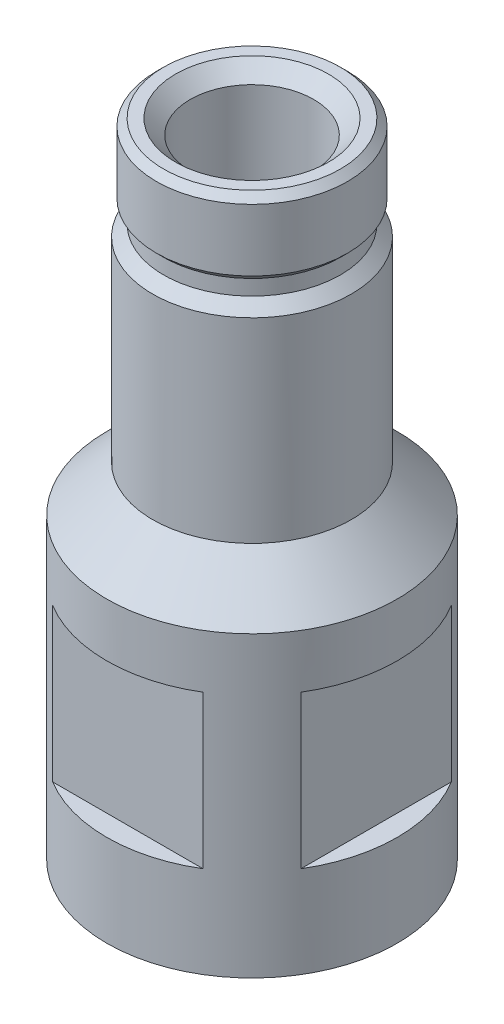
ISO-10303-21;
HEADER;
FILE_DESCRIPTION(('STEP AP214'),'2;1');
FILE_NAME('part.step','',(''),(''),'','','');
FILE_SCHEMA(('AUTOMOTIVE_DESIGN { 1 0 10303 214 1 1 1 1 }'));
ENDSEC;
DATA;
#1=APPLICATION_CONTEXT('core data for automotive mechanical design processes');
#2=APPLICATION_PROTOCOL_DEFINITION('international standard','automotive_design',2000,#1);
#3=PRODUCT_CONTEXT('',#1,'mechanical');
#4=PRODUCT('Part','Part','',(#3));
#5=PRODUCT_RELATED_PRODUCT_CATEGORY('part','',(#4));
#6=PRODUCT_DEFINITION_FORMATION('','',#4);
#7=PRODUCT_DEFINITION_CONTEXT('part definition',#1,'design');
#8=PRODUCT_DEFINITION('design','',#6,#7);
#9=PRODUCT_DEFINITION_SHAPE('','',#8);
#10=(LENGTH_UNIT() NAMED_UNIT(*) SI_UNIT(.MILLI.,.METRE.));
#11=(NAMED_UNIT(*) PLANE_ANGLE_UNIT() SI_UNIT($,.RADIAN.));
#12=(NAMED_UNIT(*) SI_UNIT($,.STERADIAN.) SOLID_ANGLE_UNIT());
#13=UNCERTAINTY_MEASURE_WITH_UNIT(LENGTH_MEASURE(1.E-05),#10,'distance_accuracy_value','');
#14=(GEOMETRIC_REPRESENTATION_CONTEXT(3) GLOBAL_UNCERTAINTY_ASSIGNED_CONTEXT((#13)) GLOBAL_UNIT_ASSIGNED_CONTEXT((#10,
#11,#12)) REPRESENTATION_CONTEXT('',''));
#15=CARTESIAN_POINT('',(0.,0.,0.));
#16=DIRECTION('',(0.,0.,1.));
#17=DIRECTION('',(1.,0.,0.));
#18=AXIS2_PLACEMENT_3D('',#15,#16,#17);
#19=CARTESIAN_POINT('',(0.,0.,0.));
#20=DIRECTION('',(0.,1.,0.));
#21=DIRECTION('',(0.,0.,1.));
#22=AXIS2_PLACEMENT_3D('',#19,#20,#21);
#23=PLANE('',#22);
#24=CARTESIAN_POINT('',(0.,0.,0.));
#25=DIRECTION('',(0.,1.,0.));
#26=DIRECTION('',(0.,0.,1.));
#27=AXIS2_PLACEMENT_3D('',#24,#25,#26);
#28=CIRCLE('',#27,11.1506);
#29=CARTESIAN_POINT('',(0.,0.,11.1506));
#30=VERTEX_POINT('',#29);
#31=EDGE_CURVE('E359',#30,#30,#28,.T.);
#32=ORIENTED_EDGE('',*,*,#31,.T.);
#33=EDGE_LOOP('',(#32));
#34=FACE_BOUND('',#33,.T.);
#35=CARTESIAN_POINT('',(0.,0.,0.));
#36=DIRECTION('',(0.,1.,0.));
#37=DIRECTION('',(0.,0.,1.));
#38=AXIS2_PLACEMENT_3D('',#35,#36,#37);
#39=CIRCLE('',#38,12.065);
#40=CARTESIAN_POINT('',(0.,0.,12.065));
#41=VERTEX_POINT('',#40);
#42=EDGE_CURVE('E125',#41,#41,#39,.T.);
#43=ORIENTED_EDGE('',*,*,#42,.F.);
#44=EDGE_LOOP('',(#43));
#45=FACE_BOUND('',#44,.T.);
#46=ADVANCED_FACE('F35',(#34,#45),#23,.F.);
#47=CARTESIAN_POINT('',(0.,53.34,0.));
#48=DIRECTION('',(0.,-1.,0.));
#49=DIRECTION('',(0.,0.,-1.));
#50=AXIS2_PLACEMENT_3D('',#47,#48,#49);
#51=CYLINDRICAL_SURFACE('',#50,12.065);
#52=DIRECTION('',(0.,-1.,0.));
#53=VECTOR('',#52,1.);
#54=CARTESIAN_POINT('',(6.25200955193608,53.34,-10.31875));
#55=LINE('',#54,#53);
#56=CARTESIAN_POINT('',(6.25200955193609,20.32,-10.31875));
#57=VERTEX_POINT('',#56);
#58=CARTESIAN_POINT('',(6.25200955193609,7.62,-10.31875));
#59=VERTEX_POINT('',#58);
#60=EDGE_CURVE('E143',#57,#59,#55,.T.);
#61=ORIENTED_EDGE('',*,*,#60,.F.);
#62=CARTESIAN_POINT('',(0.,20.32,0.));
#63=DIRECTION('',(0.,-1.,0.));
#64=DIRECTION('',(0.,0.,-1.));
#65=AXIS2_PLACEMENT_3D('',#62,#63,#64);
#66=CIRCLE('',#65,12.065);
#67=CARTESIAN_POINT('',(-6.25200955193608,20.32,-10.31875));
#68=VERTEX_POINT('',#67);
#69=EDGE_CURVE('E136',#68,#57,#66,.T.);
#70=ORIENTED_EDGE('',*,*,#69,.F.);
#71=DIRECTION('',(0.,-1.,0.));
#72=VECTOR('',#71,1.);
#73=CARTESIAN_POINT('',(-6.25200955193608,53.34,-10.31875));
#74=LINE('',#73,#72);
#75=CARTESIAN_POINT('',(-6.25200955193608,7.62,-10.31875));
#76=VERTEX_POINT('',#75);
#77=EDGE_CURVE('E139',#76,#68,#74,.F.);
#78=ORIENTED_EDGE('',*,*,#77,.F.);
#79=CARTESIAN_POINT('',(0.,7.62,0.));
#80=DIRECTION('',(0.,-1.,0.));
#81=DIRECTION('',(0.,0.,-1.));
#82=AXIS2_PLACEMENT_3D('',#79,#80,#81);
#83=CIRCLE('',#82,12.065);
#84=EDGE_CURVE('E129',#76,#59,#83,.T.);
#85=ORIENTED_EDGE('',*,*,#84,.T.);
#86=EDGE_LOOP('',(#61,#70,#78,#85));
#87=FACE_BOUND('',#86,.T.);
#88=DIRECTION('',(0.,-1.,0.));
#89=VECTOR('',#88,1.);
#90=CARTESIAN_POINT('',(-6.25200955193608,53.34,10.31875));
#91=LINE('',#90,#89);
#92=CARTESIAN_POINT('',(-6.25200955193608,20.32,10.31875));
#93=VERTEX_POINT('',#92);
#94=CARTESIAN_POINT('',(-6.25200955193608,7.62,10.31875));
#95=VERTEX_POINT('',#94);
#96=EDGE_CURVE('E99',#93,#95,#91,.T.);
#97=ORIENTED_EDGE('',*,*,#96,.F.);
#98=CARTESIAN_POINT('',(6.25200955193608,20.32,10.31875));
#99=VERTEX_POINT('',#98);
#100=EDGE_CURVE('E110',#99,#93,#66,.T.);
#101=ORIENTED_EDGE('',*,*,#100,.F.);
#102=DIRECTION('',(0.,-1.,0.));
#103=VECTOR('',#102,1.);
#104=CARTESIAN_POINT('',(6.25200955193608,53.34,10.31875));
#105=LINE('',#104,#103);
#106=CARTESIAN_POINT('',(6.25200955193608,7.62,10.31875));
#107=VERTEX_POINT('',#106);
#108=EDGE_CURVE('E119',#107,#99,#105,.F.);
#109=ORIENTED_EDGE('',*,*,#108,.F.);
#110=EDGE_CURVE('E114',#107,#95,#83,.T.);
#111=ORIENTED_EDGE('',*,*,#110,.T.);
#112=EDGE_LOOP('',(#97,#101,#109,#111));
#113=FACE_BOUND('',#112,.T.);
#114=CARTESIAN_POINT('',(0.,24.7649999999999,0.));
#115=DIRECTION('',(0.,1.,0.));
#116=DIRECTION('',(-1.,0.,0.));
#117=AXIS2_PLACEMENT_3D('',#114,#115,#116);
#118=CIRCLE('',#117,12.065);
#119=CARTESIAN_POINT('',(-12.065,24.765,0.));
#120=VERTEX_POINT('',#119);
#121=EDGE_CURVE('E195',#120,#120,#118,.T.);
#122=ORIENTED_EDGE('',*,*,#121,.F.);
#123=EDGE_LOOP('',(#122));
#124=FACE_BOUND('',#123,.T.);
#125=ORIENTED_EDGE('',*,*,#42,.T.);
#126=EDGE_LOOP('',(#125));
#127=FACE_BOUND('',#126,.T.);
#128=DIRECTION('',(0.,-1.,0.));
#129=VECTOR('',#128,1.);
#130=CARTESIAN_POINT('',(-10.31875,53.34,-6.25200955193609));
#131=LINE('',#130,#129);
#132=CARTESIAN_POINT('',(-10.31875,20.32,-6.25200955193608));
#133=VERTEX_POINT('',#132);
#134=CARTESIAN_POINT('',(-10.31875,7.62,-6.25200955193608));
#135=VERTEX_POINT('',#134);
#136=EDGE_CURVE('E135',#133,#135,#131,.T.);
#137=ORIENTED_EDGE('',*,*,#136,.F.);
#138=CARTESIAN_POINT('',(-10.31875,20.32,6.25200955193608));
#139=VERTEX_POINT('',#138);
#140=EDGE_CURVE('E124',#139,#133,#66,.T.);
#141=ORIENTED_EDGE('',*,*,#140,.F.);
#142=DIRECTION('',(0.,-1.,0.));
#143=VECTOR('',#142,1.);
#144=CARTESIAN_POINT('',(-10.31875,53.34,6.25200955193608));
#145=LINE('',#144,#143);
#146=CARTESIAN_POINT('',(-10.31875,7.62,6.25200955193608));
#147=VERTEX_POINT('',#146);
#148=EDGE_CURVE('E109',#147,#139,#145,.F.);
#149=ORIENTED_EDGE('',*,*,#148,.F.);
#150=EDGE_CURVE('E122',#147,#135,#83,.T.);
#151=ORIENTED_EDGE('',*,*,#150,.T.);
#152=EDGE_LOOP('',(#137,#141,#149,#151));
#153=FACE_BOUND('',#152,.T.);
#154=DIRECTION('',(0.,-1.,0.));
#155=VECTOR('',#154,1.);
#156=CARTESIAN_POINT('',(10.31875,53.34,6.25200955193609));
#157=LINE('',#156,#155);
#158=CARTESIAN_POINT('',(10.31875,20.32,6.25200955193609));
#159=VERTEX_POINT('',#158);
#160=CARTESIAN_POINT('',(10.31875,7.62,6.25200955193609));
#161=VERTEX_POINT('',#160);
#162=EDGE_CURVE('E12',#159,#161,#157,.T.);
#163=ORIENTED_EDGE('',*,*,#162,.F.);
#164=CARTESIAN_POINT('',(10.31875,20.32,-6.25200955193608));
#165=VERTEX_POINT('',#164);
#166=EDGE_CURVE('E43',#165,#159,#66,.T.);
#167=ORIENTED_EDGE('',*,*,#166,.F.);
#168=DIRECTION('',(0.,-1.,0.));
#169=VECTOR('',#168,1.);
#170=CARTESIAN_POINT('',(10.31875,53.34,-6.25200955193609));
#171=LINE('',#170,#169);
#172=CARTESIAN_POINT('',(10.31875,7.62,-6.25200955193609));
#173=VERTEX_POINT('',#172);
#174=EDGE_CURVE('E128',#173,#165,#171,.F.);
#175=ORIENTED_EDGE('',*,*,#174,.F.);
#176=EDGE_CURVE('E121',#173,#161,#83,.T.);
#177=ORIENTED_EDGE('',*,*,#176,.T.);
#178=EDGE_LOOP('',(#163,#167,#175,#177));
#179=FACE_BOUND('',#178,.T.);
#180=ADVANCED_FACE('F37',(#87,#113,#124,#127,#153,#179),#51,.T.);
#181=CARTESIAN_POINT('',(0.,53.34,0.));
#182=DIRECTION('',(0.,1.,0.));
#183=DIRECTION('',(0.,0.,1.));
#184=AXIS2_PLACEMENT_3D('',#181,#182,#183);
#185=PLANE('',#184);
#186=CARTESIAN_POINT('',(0.,53.34,0.));
#187=DIRECTION('',(0.,1.,0.));
#188=DIRECTION('',(-1.,0.,0.));
#189=AXIS2_PLACEMENT_3D('',#186,#187,#188);
#190=CIRCLE('',#189,6.35000000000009);
#191=CARTESIAN_POINT('',(-6.35000000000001,53.34,0.));
#192=VERTEX_POINT('',#191);
#193=EDGE_CURVE('E216',#192,#192,#190,.T.);
#194=ORIENTED_EDGE('',*,*,#193,.F.);
#195=EDGE_LOOP('',(#194));
#196=FACE_BOUND('',#195,.T.);
#197=CARTESIAN_POINT('',(0.,53.3400000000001,0.));
#198=DIRECTION('',(0.,-1.,0.));
#199=DIRECTION('',(1.,0.,0.));
#200=AXIS2_PLACEMENT_3D('',#197,#198,#199);
#201=CIRCLE('',#200,7.34060000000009);
#202=CARTESIAN_POINT('',(7.34060000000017,53.3400000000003,0.));
#203=VERTEX_POINT('',#202);
#204=EDGE_CURVE('E174',#203,#203,#201,.T.);
#205=ORIENTED_EDGE('',*,*,#204,.F.);
#206=EDGE_LOOP('',(#205));
#207=FACE_BOUND('',#206,.T.);
#208=ADVANCED_FACE('F229',(#196,#207),#185,.T.);
#209=CARTESIAN_POINT('',(0.,0.,0.));
#210=DIRECTION('',(0.,1.,0.));
#211=DIRECTION('',(-1.,0.,0.));
#212=AXIS2_PLACEMENT_3D('',#209,#210,#211);
#213=CYLINDRICAL_SURFACE('',#212,8.25500000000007);
#214=CARTESIAN_POINT('',(0.,28.575,0.));
#215=DIRECTION('',(0.,1.,0.));
#216=DIRECTION('',(-1.,0.,0.));
#217=AXIS2_PLACEMENT_3D('',#214,#215,#216);
#218=CIRCLE('',#217,8.25500000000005);
#219=CARTESIAN_POINT('',(-8.255,28.575,0.));
#220=VERTEX_POINT('',#219);
#221=EDGE_CURVE('E192',#220,#220,#218,.T.);
#222=ORIENTED_EDGE('',*,*,#221,.T.);
#223=EDGE_LOOP('',(#222));
#224=FACE_BOUND('',#223,.T.);
#225=CARTESIAN_POINT('',(2.6162884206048E-13,44.8056000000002,0.));
#226=DIRECTION('',(0.,-1.,0.));
#227=DIRECTION('',(1.,0.,0.));
#228=AXIS2_PLACEMENT_3D('',#225,#226,#227);
#229=CIRCLE('',#228,8.25500000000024);
#230=CARTESIAN_POINT('',(8.25500000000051,44.8056000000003,0.));
#231=VERTEX_POINT('',#230);
#232=EDGE_CURVE('E189',#231,#231,#229,.T.);
#233=ORIENTED_EDGE('',*,*,#232,.T.);
#234=EDGE_LOOP('',(#233));
#235=FACE_BOUND('',#234,.T.);
#236=ADVANCED_FACE('F234',(#224,#235),#213,.T.);
#237=CARTESIAN_POINT('',(0.,0.,0.));
#238=DIRECTION('',(0.,1.,0.));
#239=DIRECTION('',(0.,0.,1.));
#240=AXIS2_PLACEMENT_3D('',#237,#238,#239);
#241=CIRCLE('',#240,8.5852);
#242=CARTESIAN_POINT('',(0.,0.,8.5852));
#243=VERTEX_POINT('',#242);
#244=EDGE_CURVE('E248',#243,#243,#241,.T.);
#245=ORIENTED_EDGE('',*,*,#244,.F.);
#246=EDGE_LOOP('',(#245));
#247=FACE_BOUND('',#246,.T.);
#248=CARTESIAN_POINT('',(0.,0.,0.));
#249=DIRECTION('',(0.,1.,0.));
#250=DIRECTION('',(-1.,0.,0.));
#251=AXIS2_PLACEMENT_3D('',#248,#249,#250);
#252=CIRCLE('',#251,6.1341);
#253=CARTESIAN_POINT('',(-6.1341,0.,0.));
#254=VERTEX_POINT('',#253);
#255=EDGE_CURVE('E198',#254,#254,#252,.T.);
#256=ORIENTED_EDGE('',*,*,#255,.T.);
#257=EDGE_LOOP('',(#256));
#258=FACE_BOUND('',#257,.T.);
#259=ADVANCED_FACE('F225',(#247,#258),#23,.F.);
#260=CARTESIAN_POINT('',(0.,53.34,0.));
#261=DIRECTION('',(0.,1.,0.));
#262=DIRECTION('',(-1.,0.,0.));
#263=AXIS2_PLACEMENT_3D('',#260,#261,#262);
#264=CONICAL_SURFACE('',#263,6.35000000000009,0.785398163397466);
#265=CARTESIAN_POINT('',(0.,52.1208,0.));
#266=DIRECTION('',(0.,1.,0.));
#267=DIRECTION('',(-1.,0.,0.));
#268=AXIS2_PLACEMENT_3D('',#265,#266,#267);
#269=CIRCLE('',#268,5.13080000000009);
#270=CARTESIAN_POINT('',(-5.1308,52.1208,0.));
#271=VERTEX_POINT('',#270);
#272=EDGE_CURVE('E213',#271,#271,#269,.T.);
#273=ORIENTED_EDGE('',*,*,#272,.F.);
#274=EDGE_LOOP('',(#273));
#275=FACE_BOUND('',#274,.T.);
#276=ORIENTED_EDGE('',*,*,#193,.T.);
#277=EDGE_LOOP('',(#276));
#278=FACE_BOUND('',#277,.T.);
#279=ADVANCED_FACE('F233',(#275,#278),#264,.F.);
#280=CARTESIAN_POINT('',(0.,0.,0.));
#281=DIRECTION('',(0.,1.,0.));
#282=DIRECTION('',(-1.,0.,0.));
#283=AXIS2_PLACEMENT_3D('',#280,#281,#282);
#284=CYLINDRICAL_SURFACE('',#283,5.13080000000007);
#285=CARTESIAN_POINT('',(0.,25.4,0.));
#286=DIRECTION('',(0.,1.,0.));
#287=DIRECTION('',(-1.,0.,0.));
#288=AXIS2_PLACEMENT_3D('',#285,#286,#287);
#289=CIRCLE('',#288,5.13080000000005);
#290=CARTESIAN_POINT('',(-5.13080000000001,25.4,0.));
#291=VERTEX_POINT('',#290);
#292=EDGE_CURVE('E210',#291,#291,#289,.T.);
#293=ORIENTED_EDGE('',*,*,#292,.F.);
#294=EDGE_LOOP('',(#293));
#295=FACE_BOUND('',#294,.T.);
#296=ORIENTED_EDGE('',*,*,#272,.T.);
#297=EDGE_LOOP('',(#296));
#298=FACE_BOUND('',#297,.T.);
#299=ADVANCED_FACE('F240',(#295,#298),#284,.F.);
#300=CARTESIAN_POINT('',(-5.7531,25.4,0.));
#301=DIRECTION('',(0.,1.,0.));
#302=DIRECTION('',(-1.,0.,0.));
#303=AXIS2_PLACEMENT_3D('',#300,#301,#302);
#304=PLANE('',#303);
#305=CARTESIAN_POINT('',(0.,25.4,0.));
#306=DIRECTION('',(0.,1.,0.));
#307=DIRECTION('',(-1.,0.,0.));
#308=AXIS2_PLACEMENT_3D('',#305,#306,#307);
#309=CIRCLE('',#308,5.75310000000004);
#310=CARTESIAN_POINT('',(-5.7531,25.4,0.));
#311=VERTEX_POINT('',#310);
#312=EDGE_CURVE('E207',#311,#311,#309,.T.);
#313=ORIENTED_EDGE('',*,*,#312,.F.);
#314=EDGE_LOOP('',(#313));
#315=FACE_BOUND('',#314,.T.);
#316=ORIENTED_EDGE('',*,*,#292,.T.);
#317=EDGE_LOOP('',(#316));
#318=FACE_BOUND('',#317,.T.);
#319=ADVANCED_FACE('F267',(#315,#318),#304,.F.);
#320=CARTESIAN_POINT('',(0.,0.,0.));
#321=DIRECTION('',(0.,1.,0.));
#322=DIRECTION('',(-1.,0.,0.));
#323=AXIS2_PLACEMENT_3D('',#320,#321,#322);
#324=CYLINDRICAL_SURFACE('',#323,5.75310000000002);
#325=CARTESIAN_POINT('',(0.,3.39497045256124,0.));
#326=DIRECTION('',(0.,1.,0.));
#327=DIRECTION('',(-1.,0.,0.));
#328=AXIS2_PLACEMENT_3D('',#325,#326,#327);
#329=CIRCLE('',#328,5.75310000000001);
#330=CARTESIAN_POINT('',(-5.7531,3.39497045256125,0.));
#331=VERTEX_POINT('',#330);
#332=EDGE_CURVE('E204',#331,#331,#329,.T.);
#333=ORIENTED_EDGE('',*,*,#332,.F.);
#334=EDGE_LOOP('',(#333));
#335=FACE_BOUND('',#334,.T.);
#336=ORIENTED_EDGE('',*,*,#312,.T.);
#337=EDGE_LOOP('',(#336));
#338=FACE_BOUND('',#337,.T.);
#339=ADVANCED_FACE('F261',(#335,#338),#324,.F.);
#340=CARTESIAN_POINT('',(0.,3.39497045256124,0.));
#341=DIRECTION('',(0.,-1.,0.));
#342=DIRECTION('',(1.,0.,0.));
#343=AXIS2_PLACEMENT_3D('',#340,#341,#342);
#344=CONICAL_SURFACE('',#343,5.75310000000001,1.0471975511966);
#345=CARTESIAN_POINT('',(0.,3.17499999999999,0.));
#346=DIRECTION('',(0.,1.,0.));
#347=DIRECTION('',(-1.,0.,0.));
#348=AXIS2_PLACEMENT_3D('',#345,#346,#347);
#349=CIRCLE('',#348,6.1341);
#350=CARTESIAN_POINT('',(-6.1341,3.175,0.));
#351=VERTEX_POINT('',#350);
#352=EDGE_CURVE('E201',#351,#351,#349,.T.);
#353=ORIENTED_EDGE('',*,*,#352,.F.);
#354=EDGE_LOOP('',(#353));
#355=FACE_BOUND('',#354,.T.);
#356=ORIENTED_EDGE('',*,*,#332,.T.);
#357=EDGE_LOOP('',(#356));
#358=FACE_BOUND('',#357,.T.);
#359=ADVANCED_FACE('F255',(#355,#358),#344,.F.);
#360=CARTESIAN_POINT('',(0.,0.,0.));
#361=DIRECTION('',(0.,1.,0.));
#362=DIRECTION('',(-1.,0.,0.));
#363=AXIS2_PLACEMENT_3D('',#360,#361,#362);
#364=CYLINDRICAL_SURFACE('',#363,6.1341);
#365=ORIENTED_EDGE('',*,*,#255,.F.);
#366=EDGE_LOOP('',(#365));
#367=FACE_BOUND('',#366,.T.);
#368=ORIENTED_EDGE('',*,*,#352,.T.);
#369=EDGE_LOOP('',(#368));
#370=FACE_BOUND('',#369,.T.);
#371=ADVANCED_FACE('F251',(#367,#370),#364,.F.);
#372=CARTESIAN_POINT('',(0.,24.7649999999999,0.));
#373=DIRECTION('',(0.,-1.,0.));
#374=DIRECTION('',(1.,0.,0.));
#375=AXIS2_PLACEMENT_3D('',#372,#373,#374);
#376=CONICAL_SURFACE('',#375,12.065,0.785398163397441);
#377=ORIENTED_EDGE('',*,*,#221,.F.);
#378=EDGE_LOOP('',(#377));
#379=FACE_BOUND('',#378,.T.);
#380=ORIENTED_EDGE('',*,*,#121,.T.);
#381=EDGE_LOOP('',(#380));
#382=FACE_BOUND('',#381,.T.);
#383=ADVANCED_FACE('F254',(#379,#382),#376,.T.);
#384=CARTESIAN_POINT('',(2.6162884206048E-13,44.8056000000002,0.));
#385=DIRECTION('',(0.,-1.,0.));
#386=DIRECTION('',(1.,0.,0.));
#387=AXIS2_PLACEMENT_3D('',#384,#385,#386);
#388=CONICAL_SURFACE('',#387,8.25500000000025,0.785398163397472);
#389=CARTESIAN_POINT('',(2.42983273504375E-13,45.7200000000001,0.));
#390=DIRECTION('',(0.,-1.,0.));
#391=DIRECTION('',(1.,0.,0.));
#392=AXIS2_PLACEMENT_3D('',#389,#390,#391);
#393=CIRCLE('',#392,7.34060000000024);
#394=CARTESIAN_POINT('',(7.34060000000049,45.7200000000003,0.));
#395=VERTEX_POINT('',#394);
#396=EDGE_CURVE('E186',#395,#395,#393,.T.);
#397=ORIENTED_EDGE('',*,*,#396,.T.);
#398=EDGE_LOOP('',(#397));
#399=FACE_BOUND('',#398,.T.);
#400=ORIENTED_EDGE('',*,*,#232,.F.);
#401=EDGE_LOOP('',(#400));
#402=FACE_BOUND('',#401,.T.);
#403=ADVANCED_FACE('F308',(#399,#402),#388,.T.);
#404=CARTESIAN_POINT('',(0.,53.34,0.));
#405=DIRECTION('',(0.,-1.,0.));
#406=DIRECTION('',(1.,0.,0.));
#407=AXIS2_PLACEMENT_3D('',#404,#405,#406);
#408=CYLINDRICAL_SURFACE('',#407,7.34060000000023);
#409=CARTESIAN_POINT('',(2.17086650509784E-13,46.9900000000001,0.));
#410=DIRECTION('',(0.,-1.,0.));
#411=DIRECTION('',(1.,0.,0.));
#412=AXIS2_PLACEMENT_3D('',#409,#410,#411);
#413=CIRCLE('',#412,7.34060000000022);
#414=CARTESIAN_POINT('',(7.34060000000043,46.9900000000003,0.));
#415=VERTEX_POINT('',#414);
#416=EDGE_CURVE('E183',#415,#415,#413,.T.);
#417=ORIENTED_EDGE('',*,*,#416,.T.);
#418=EDGE_LOOP('',(#417));
#419=FACE_BOUND('',#418,.T.);
#420=ORIENTED_EDGE('',*,*,#396,.F.);
#421=EDGE_LOOP('',(#420));
#422=FACE_BOUND('',#421,.T.);
#423=ADVANCED_FACE('F302',(#419,#422),#408,.T.);
#424=CARTESIAN_POINT('',(2.17086650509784E-13,46.9900000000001,0.));
#425=DIRECTION('',(0.,1.,0.));
#426=DIRECTION('',(-1.,0.,0.));
#427=AXIS2_PLACEMENT_3D('',#424,#425,#426);
#428=CONICAL_SURFACE('',#427,7.34060000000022,0.785398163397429);
#429=CARTESIAN_POINT('',(2.04915237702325E-13,47.5869000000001,0.));
#430=DIRECTION('',(0.,-1.,0.));
#431=DIRECTION('',(1.,0.,0.));
#432=AXIS2_PLACEMENT_3D('',#429,#430,#431);
#433=CIRCLE('',#432,7.93750000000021);
#434=CARTESIAN_POINT('',(7.93750000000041,47.5869000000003,0.));
#435=VERTEX_POINT('',#434);
#436=EDGE_CURVE('E180',#435,#435,#433,.T.);
#437=ORIENTED_EDGE('',*,*,#436,.T.);
#438=EDGE_LOOP('',(#437));
#439=FACE_BOUND('',#438,.T.);
#440=ORIENTED_EDGE('',*,*,#416,.F.);
#441=EDGE_LOOP('',(#440));
#442=FACE_BOUND('',#441,.T.);
#443=ADVANCED_FACE('F296',(#439,#442),#428,.T.);
#444=CARTESIAN_POINT('',(0.,53.34,0.));
#445=DIRECTION('',(0.,-1.,0.));
#446=DIRECTION('',(1.,0.,0.));
#447=AXIS2_PLACEMENT_3D('',#444,#445,#446);
#448=CYLINDRICAL_SURFACE('',#447,7.93750000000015);
#449=CARTESIAN_POINT('',(0.,52.7431000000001,0.));
#450=DIRECTION('',(0.,-1.,0.));
#451=DIRECTION('',(1.,0.,0.));
#452=AXIS2_PLACEMENT_3D('',#449,#450,#451);
#453=CIRCLE('',#452,7.9375000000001);
#454=CARTESIAN_POINT('',(7.9375000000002,52.7431000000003,0.));
#455=VERTEX_POINT('',#454);
#456=EDGE_CURVE('E177',#455,#455,#453,.T.);
#457=ORIENTED_EDGE('',*,*,#456,.T.);
#458=EDGE_LOOP('',(#457));
#459=FACE_BOUND('',#458,.T.);
#460=ORIENTED_EDGE('',*,*,#436,.F.);
#461=EDGE_LOOP('',(#460));
#462=FACE_BOUND('',#461,.T.);
#463=ADVANCED_FACE('F290',(#459,#462),#448,.T.);
#464=CARTESIAN_POINT('',(0.,52.7431000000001,0.));
#465=DIRECTION('',(0.,-1.,0.));
#466=DIRECTION('',(1.,0.,0.));
#467=AXIS2_PLACEMENT_3D('',#464,#465,#466);
#468=CONICAL_SURFACE('',#467,7.9375000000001,0.785398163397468);
#469=ORIENTED_EDGE('',*,*,#204,.T.);
#470=EDGE_LOOP('',(#469));
#471=FACE_BOUND('',#470,.T.);
#472=ORIENTED_EDGE('',*,*,#456,.F.);
#473=EDGE_LOOP('',(#472));
#474=FACE_BOUND('',#473,.T.);
#475=ADVANCED_FACE('F287',(#471,#474),#468,.T.);
#476=CARTESIAN_POINT('',(-10.31875,20.32,10.31875));
#477=DIRECTION('',(0.,0.,1.));
#478=DIRECTION('',(1.,0.,0.));
#479=AXIS2_PLACEMENT_3D('',#476,#477,#478);
#480=PLANE('',#479);
#481=ORIENTED_EDGE('',*,*,#96,.T.);
#482=DIRECTION('',(-1.,0.,0.));
#483=VECTOR('',#482,1.);
#484=CARTESIAN_POINT('',(-10.31875,7.62,10.31875));
#485=LINE('',#484,#483);
#486=EDGE_CURVE('E102',#107,#95,#485,.T.);
#487=ORIENTED_EDGE('',*,*,#486,.F.);
#488=ORIENTED_EDGE('',*,*,#108,.T.);
#489=DIRECTION('',(-1.,0.,0.));
#490=VECTOR('',#489,1.);
#491=CARTESIAN_POINT('',(-10.31875,20.32,10.31875));
#492=LINE('',#491,#490);
#493=EDGE_CURVE('E105',#99,#93,#492,.T.);
#494=ORIENTED_EDGE('',*,*,#493,.T.);
#495=EDGE_LOOP('',(#481,#487,#488,#494));
#496=FACE_BOUND('',#495,.T.);
#497=ADVANCED_FACE('F101',(#496),#480,.T.);
#498=CARTESIAN_POINT('',(0.,7.62,0.));
#499=DIRECTION('',(0.,-1.,0.));
#500=DIRECTION('',(0.,0.,-1.));
#501=AXIS2_PLACEMENT_3D('',#498,#499,#500);
#502=PLANE('',#501);
#503=ORIENTED_EDGE('',*,*,#486,.T.);
#504=ORIENTED_EDGE('',*,*,#110,.F.);
#505=EDGE_LOOP('',(#503,#504));
#506=FACE_BOUND('',#505,.T.);
#507=ADVANCED_FACE('F113',(#506),#502,.F.);
#508=CARTESIAN_POINT('',(0.,20.32,0.));
#509=DIRECTION('',(0.,-1.,0.));
#510=DIRECTION('',(0.,0.,-1.));
#511=AXIS2_PLACEMENT_3D('',#508,#509,#510);
#512=PLANE('',#511);
#513=ORIENTED_EDGE('',*,*,#100,.T.);
#514=ORIENTED_EDGE('',*,*,#493,.F.);
#515=EDGE_LOOP('',(#513,#514));
#516=FACE_BOUND('',#515,.T.);
#517=ADVANCED_FACE('F329',(#516),#512,.T.);
#518=CARTESIAN_POINT('',(-10.31875,20.32,10.31875));
#519=DIRECTION('',(-1.,0.,0.));
#520=DIRECTION('',(0.,0.,1.));
#521=AXIS2_PLACEMENT_3D('',#518,#519,#520);
#522=PLANE('',#521);
#523=ORIENTED_EDGE('',*,*,#136,.T.);
#524=DIRECTION('',(0.,0.,-1.));
#525=VECTOR('',#524,1.);
#526=CARTESIAN_POINT('',(-10.31875,7.62,10.31875));
#527=LINE('',#526,#525);
#528=EDGE_CURVE('E116',#147,#135,#527,.T.);
#529=ORIENTED_EDGE('',*,*,#528,.F.);
#530=ORIENTED_EDGE('',*,*,#148,.T.);
#531=DIRECTION('',(0.,0.,-1.));
#532=VECTOR('',#531,1.);
#533=CARTESIAN_POINT('',(-10.31875,20.32,10.31875));
#534=LINE('',#533,#532);
#535=EDGE_CURVE('E364',#139,#133,#534,.T.);
#536=ORIENTED_EDGE('',*,*,#535,.T.);
#537=EDGE_LOOP('',(#523,#529,#530,#536));
#538=FACE_BOUND('',#537,.T.);
#539=ADVANCED_FACE('F335',(#538),#522,.T.);
#540=ORIENTED_EDGE('',*,*,#528,.T.);
#541=ORIENTED_EDGE('',*,*,#150,.F.);
#542=EDGE_LOOP('',(#540,#541));
#543=FACE_BOUND('',#542,.T.);
#544=ADVANCED_FACE('F338',(#543),#502,.F.);
#545=ORIENTED_EDGE('',*,*,#140,.T.);
#546=ORIENTED_EDGE('',*,*,#535,.F.);
#547=EDGE_LOOP('',(#545,#546));
#548=FACE_BOUND('',#547,.T.);
#549=ADVANCED_FACE('F343',(#548),#512,.T.);
#550=CARTESIAN_POINT('',(-10.31875,20.32,-10.31875));
#551=DIRECTION('',(0.,0.,-1.));
#552=DIRECTION('',(-1.,0.,0.));
#553=AXIS2_PLACEMENT_3D('',#550,#551,#552);
#554=PLANE('',#553);
#555=ORIENTED_EDGE('',*,*,#60,.T.);
#556=DIRECTION('',(1.,0.,0.));
#557=VECTOR('',#556,1.);
#558=CARTESIAN_POINT('',(-10.31875,7.62,-10.31875));
#559=LINE('',#558,#557);
#560=EDGE_CURVE('E57',#76,#59,#559,.T.);
#561=ORIENTED_EDGE('',*,*,#560,.F.);
#562=ORIENTED_EDGE('',*,*,#77,.T.);
#563=DIRECTION('',(1.,0.,0.));
#564=VECTOR('',#563,1.);
#565=CARTESIAN_POINT('',(-10.31875,20.32,-10.31875));
#566=LINE('',#565,#564);
#567=EDGE_CURVE('E168',#68,#57,#566,.T.);
#568=ORIENTED_EDGE('',*,*,#567,.T.);
#569=EDGE_LOOP('',(#555,#561,#562,#568));
#570=FACE_BOUND('',#569,.T.);
#571=ADVANCED_FACE('F340',(#570),#554,.T.);
#572=ORIENTED_EDGE('',*,*,#560,.T.);
#573=ORIENTED_EDGE('',*,*,#84,.F.);
#574=EDGE_LOOP('',(#572,#573));
#575=FACE_BOUND('',#574,.T.);
#576=ADVANCED_FACE('F325',(#575),#502,.F.);
#577=ORIENTED_EDGE('',*,*,#69,.T.);
#578=ORIENTED_EDGE('',*,*,#567,.F.);
#579=EDGE_LOOP('',(#577,#578));
#580=FACE_BOUND('',#579,.T.);
#581=ADVANCED_FACE('F328',(#580),#512,.T.);
#582=ORIENTED_EDGE('',*,*,#166,.T.);
#583=DIRECTION('',(0.,0.,1.));
#584=VECTOR('',#583,1.);
#585=CARTESIAN_POINT('',(10.31875,20.32,10.31875));
#586=LINE('',#585,#584);
#587=EDGE_CURVE('E153',#165,#159,#586,.T.);
#588=ORIENTED_EDGE('',*,*,#587,.F.);
#589=EDGE_LOOP('',(#582,#588));
#590=FACE_BOUND('',#589,.T.);
#591=ADVANCED_FACE('F158',(#590),#512,.T.);
#592=DIRECTION('',(0.,0.,1.));
#593=VECTOR('',#592,1.);
#594=CARTESIAN_POINT('',(10.31875,7.62,10.31875));
#595=LINE('',#594,#593);
#596=EDGE_CURVE('E49',#173,#161,#595,.T.);
#597=ORIENTED_EDGE('',*,*,#596,.T.);
#598=ORIENTED_EDGE('',*,*,#176,.F.);
#599=EDGE_LOOP('',(#597,#598));
#600=FACE_BOUND('',#599,.T.);
#601=ADVANCED_FACE('F161',(#600),#502,.F.);
#602=CARTESIAN_POINT('',(10.31875,20.32,10.31875));
#603=DIRECTION('',(1.,0.,0.));
#604=DIRECTION('',(0.,0.,-1.));
#605=AXIS2_PLACEMENT_3D('',#602,#603,#604);
#606=PLANE('',#605);
#607=ORIENTED_EDGE('',*,*,#162,.T.);
#608=ORIENTED_EDGE('',*,*,#596,.F.);
#609=ORIENTED_EDGE('',*,*,#174,.T.);
#610=ORIENTED_EDGE('',*,*,#587,.T.);
#611=EDGE_LOOP('',(#607,#608,#609,#610));
#612=FACE_BOUND('',#611,.T.);
#613=ADVANCED_FACE('F152',(#612),#606,.T.);
#614=CARTESIAN_POINT('',(0.,0.,0.));
#615=DIRECTION('',(0.,1.,0.));
#616=DIRECTION('',(0.,0.,1.));
#617=AXIS2_PLACEMENT_3D('',#614,#615,#616);
#618=CYLINDRICAL_SURFACE('',#617,11.1506);
#619=ORIENTED_EDGE('',*,*,#31,.F.);
#620=EDGE_LOOP('',(#619));
#621=FACE_BOUND('',#620,.T.);
#622=CARTESIAN_POINT('',(0.,1.27,0.));
#623=DIRECTION('',(0.,1.,0.));
#624=DIRECTION('',(0.,0.,1.));
#625=AXIS2_PLACEMENT_3D('',#622,#623,#624);
#626=CIRCLE('',#625,11.1506);
#627=CARTESIAN_POINT('',(0.,1.27,11.1506));
#628=VERTEX_POINT('',#627);
#629=EDGE_CURVE('E162',#628,#628,#626,.T.);
#630=ORIENTED_EDGE('',*,*,#629,.T.);
#631=EDGE_LOOP('',(#630));
#632=FACE_BOUND('',#631,.T.);
#633=ADVANCED_FACE('F332',(#621,#632),#618,.F.);
#634=CARTESIAN_POINT('',(-11.1506,1.27,0.));
#635=DIRECTION('',(0.,1.,0.));
#636=DIRECTION('',(0.,0.,1.));
#637=AXIS2_PLACEMENT_3D('',#634,#635,#636);
#638=PLANE('',#637);
#639=ORIENTED_EDGE('',*,*,#629,.F.);
#640=EDGE_LOOP('',(#639));
#641=FACE_BOUND('',#640,.T.);
#642=CARTESIAN_POINT('',(0.,1.27,0.));
#643=DIRECTION('',(0.,1.,0.));
#644=DIRECTION('',(0.,0.,1.));
#645=AXIS2_PLACEMENT_3D('',#642,#643,#644);
#646=CIRCLE('',#645,8.5852);
#647=CARTESIAN_POINT('',(0.,1.27,8.5852));
#648=VERTEX_POINT('',#647);
#649=EDGE_CURVE('E165',#648,#648,#646,.T.);
#650=ORIENTED_EDGE('',*,*,#649,.T.);
#651=EDGE_LOOP('',(#650));
#652=FACE_BOUND('',#651,.T.);
#653=ADVANCED_FACE('F346',(#641,#652),#638,.F.);
#654=CARTESIAN_POINT('',(0.,0.,0.));
#655=DIRECTION('',(0.,1.,0.));
#656=DIRECTION('',(0.,0.,1.));
#657=AXIS2_PLACEMENT_3D('',#654,#655,#656);
#658=CYLINDRICAL_SURFACE('',#657,8.5852);
#659=ORIENTED_EDGE('',*,*,#649,.F.);
#660=EDGE_LOOP('',(#659));
#661=FACE_BOUND('',#660,.T.);
#662=ORIENTED_EDGE('',*,*,#244,.T.);
#663=EDGE_LOOP('',(#662));
#664=FACE_BOUND('',#663,.T.);
#665=ADVANCED_FACE('F350',(#661,#664),#658,.T.);
#666=CLOSED_SHELL('',(#46,#180,#208,#236,#259,#279,#299,#319,#339,#359,#371,#383,#403,#423,#443,
#463,#475,#497,#507,#517,#539,#544,#549,#571,#576,#581,#591,#601,#613,#633,#653,#665));
#667=MANIFOLD_SOLID_BREP('B2',#666);
#668=ADVANCED_BREP_SHAPE_REPRESENTATION('',(#18,#667),#14);
#669=SHAPE_DEFINITION_REPRESENTATION(#9,#668);
ENDSEC;
END-ISO-10303-21;
